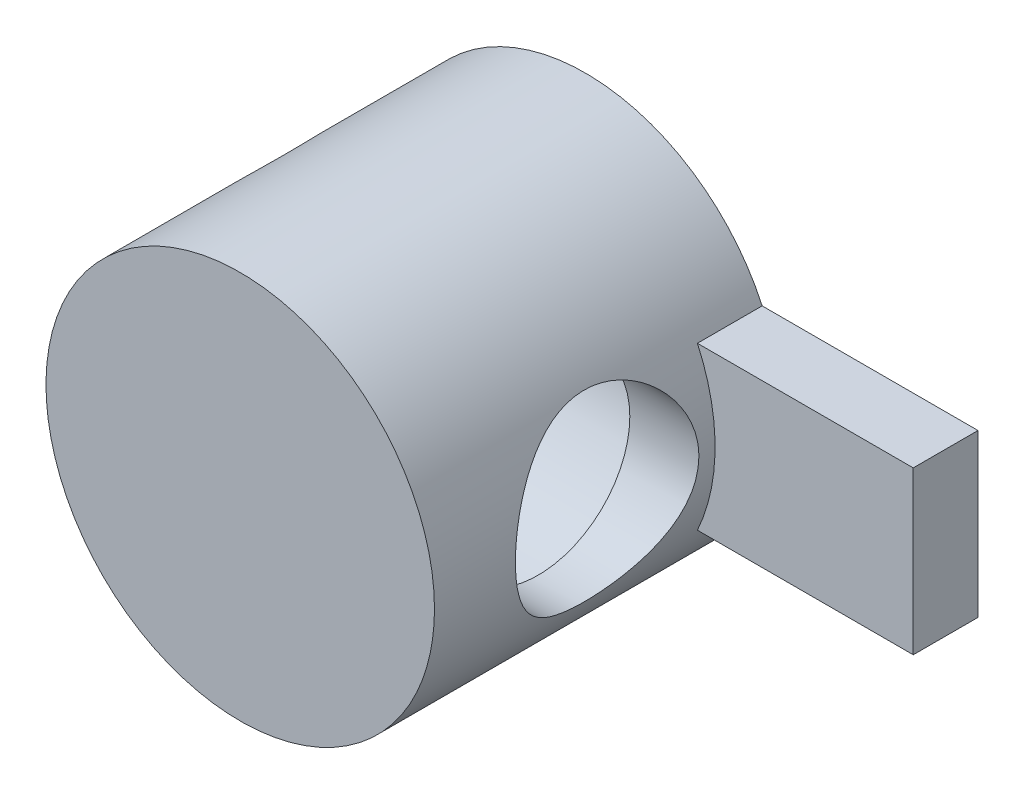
ISO-10303-21;
HEADER;
FILE_DESCRIPTION(('STEP AP214'),'2;1');
FILE_NAME('part.step','',(''),(''),'','','');
FILE_SCHEMA(('AUTOMOTIVE_DESIGN { 1 0 10303 214 1 1 1 1 }'));
ENDSEC;
DATA;
#1=APPLICATION_CONTEXT('core data for automotive mechanical design processes');
#2=APPLICATION_PROTOCOL_DEFINITION('international standard','automotive_design',2000,#1);
#3=PRODUCT_CONTEXT('',#1,'mechanical');
#4=PRODUCT('Part','Part','',(#3));
#5=PRODUCT_RELATED_PRODUCT_CATEGORY('part','',(#4));
#6=PRODUCT_DEFINITION_FORMATION('','',#4);
#7=PRODUCT_DEFINITION_CONTEXT('part definition',#1,'design');
#8=PRODUCT_DEFINITION('design','',#6,#7);
#9=PRODUCT_DEFINITION_SHAPE('','',#8);
#10=(LENGTH_UNIT() NAMED_UNIT(*) SI_UNIT(.MILLI.,.METRE.));
#11=(NAMED_UNIT(*) PLANE_ANGLE_UNIT() SI_UNIT($,.RADIAN.));
#12=(NAMED_UNIT(*) SI_UNIT($,.STERADIAN.) SOLID_ANGLE_UNIT());
#13=UNCERTAINTY_MEASURE_WITH_UNIT(LENGTH_MEASURE(1.E-05),#10,'distance_accuracy_value','');
#14=(GEOMETRIC_REPRESENTATION_CONTEXT(3) GLOBAL_UNCERTAINTY_ASSIGNED_CONTEXT((#13)) GLOBAL_UNIT_ASSIGNED_CONTEXT((#10,
#11,#12)) REPRESENTATION_CONTEXT('',''));
#15=CARTESIAN_POINT('',(0.,0.,0.));
#16=DIRECTION('',(0.,0.,1.));
#17=DIRECTION('',(1.,0.,0.));
#18=AXIS2_PLACEMENT_3D('',#15,#16,#17);
#19=CARTESIAN_POINT('',(0.,0.,8.));
#20=DIRECTION('',(0.,0.,-1.));
#21=DIRECTION('',(-1.,0.,0.));
#22=AXIS2_PLACEMENT_3D('',#19,#20,#21);
#23=CYLINDRICAL_SURFACE('',#22,9.);
#24=CARTESIAN_POINT('',(-9.,0.,6.75));
#25=CARTESIAN_POINT('',(-8.99999842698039,-0.164833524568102,6.74999837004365));
#26=CARTESIAN_POINT('',(-8.99546059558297,-0.329708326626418,6.74395113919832));
#27=CARTESIAN_POINT('',(-8.97741128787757,-0.658156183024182,6.71985678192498));
#28=CARTESIAN_POINT('',(-8.96389444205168,-0.821728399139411,6.70180247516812));
#29=CARTESIAN_POINT('',(-8.92817260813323,-1.14650348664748,6.65394772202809));
#30=CARTESIAN_POINT('',(-8.9059510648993,-1.30770123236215,6.62412489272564));
#31=CARTESIAN_POINT('',(-8.85331955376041,-1.62629043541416,6.5531924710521));
#32=CARTESIAN_POINT('',(-8.82290593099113,-1.78368015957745,6.51207784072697));
#33=CARTESIAN_POINT('',(-8.75477140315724,-2.09256295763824,6.41946268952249));
#34=CARTESIAN_POINT('',(-8.71709991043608,-2.24408802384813,6.36803230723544));
#35=CARTESIAN_POINT('',(-8.63506340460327,-2.54156013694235,6.25526249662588));
#36=CARTESIAN_POINT('',(-8.59069574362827,-2.68750494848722,6.193919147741));
#37=CARTESIAN_POINT('',(-8.44881158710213,-3.11573160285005,5.99611691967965));
#38=CARTESIAN_POINT('',(-8.34242195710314,-3.38880795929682,5.8457629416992));
#39=CARTESIAN_POINT('',(-8.10222374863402,-3.93064227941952,5.4978036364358));
#40=CARTESIAN_POINT('',(-7.96678840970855,-4.19665857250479,5.29711200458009));
#41=CARTESIAN_POINT('',(-7.68449624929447,-4.69363323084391,4.8622537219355));
#42=CARTESIAN_POINT('',(-7.53762195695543,-4.92453631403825,4.62803538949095));
#43=CARTESIAN_POINT('',(-7.30107493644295,-5.26484912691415,4.22879467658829));
#44=CARTESIAN_POINT('',(-7.211900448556,-5.38603829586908,4.07333143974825));
#45=CARTESIAN_POINT('',(-7.03523013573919,-5.61483758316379,3.75167526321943));
#46=CARTESIAN_POINT('',(-6.94773482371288,-5.72244360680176,3.58547911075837));
#47=CARTESIAN_POINT('',(-6.77721999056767,-5.92339751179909,3.24272597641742));
#48=CARTESIAN_POINT('',(-6.69419605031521,-6.01675964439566,3.06617959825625));
#49=CARTESIAN_POINT('',(-6.53575493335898,-6.18850139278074,2.702841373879));
#50=CARTESIAN_POINT('',(-6.46033343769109,-6.26688953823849,2.51605543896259));
#51=CARTESIAN_POINT('',(-6.29897361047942,-6.42960790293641,2.07229180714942));
#52=CARTESIAN_POINT('',(-6.21708569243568,-6.50817338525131,1.81158388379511));
#53=CARTESIAN_POINT('',(-6.11624435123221,-6.60255072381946,1.40987724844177));
#54=CARTESIAN_POINT('',(-6.08630638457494,-6.63008907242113,1.27428058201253));
#55=CARTESIAN_POINT('',(-6.03486987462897,-6.67694238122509,1.00012349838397));
#56=CARTESIAN_POINT('',(-6.01336698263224,-6.69626157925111,0.86156464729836));
#57=CARTESIAN_POINT('',(-5.97959538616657,-6.72643761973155,0.58105379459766));
#58=CARTESIAN_POINT('',(-5.96741601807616,-6.73721262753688,0.439082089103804));
#59=CARTESIAN_POINT('',(-5.95323912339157,-6.74974333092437,0.154229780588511));
#60=CARTESIAN_POINT('',(-5.9512413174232,-6.7514992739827,0.0113492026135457));
#61=CARTESIAN_POINT('',(-5.95753758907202,-6.74594437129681,-0.274056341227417));
#62=CARTESIAN_POINT('',(-5.96583503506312,-6.73863055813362,-0.416581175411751));
#63=CARTESIAN_POINT('',(-5.99228400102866,-6.71511944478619,-0.699936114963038));
#64=CARTESIAN_POINT('',(-6.01043562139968,-6.698922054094,-0.840766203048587));
#65=CARTESIAN_POINT('',(-6.07356895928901,-6.64189768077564,-1.22917471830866));
#66=CARTESIAN_POINT('',(-6.12842794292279,-6.59171717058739,-1.4738450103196));
#67=CARTESIAN_POINT('',(-6.26013279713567,-6.46674991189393,-1.95054367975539));
#68=CARTESIAN_POINT('',(-6.33699979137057,-6.39193951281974,-2.18255965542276));
#69=CARTESIAN_POINT('',(-6.48989238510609,-6.2362564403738,-2.59035253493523));
#70=CARTESIAN_POINT('',(-6.56339716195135,-6.15912150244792,-2.76854348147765));
#71=CARTESIAN_POINT('',(-6.71707949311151,-5.99114350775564,-3.11542288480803));
#72=CARTESIAN_POINT('',(-6.79726046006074,-5.90029342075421,-3.28410640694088));
#73=CARTESIAN_POINT('',(-6.96166040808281,-5.70539900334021,-3.61211745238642));
#74=CARTESIAN_POINT('',(-7.04588742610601,-5.60132767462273,-3.77142482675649));
#75=CARTESIAN_POINT('',(-7.21585398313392,-5.38059984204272,-4.08015259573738));
#76=CARTESIAN_POINT('',(-7.30159328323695,-5.26394531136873,-4.22957453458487));
#77=CARTESIAN_POINT('',(-7.47469307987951,-5.01522662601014,-4.52191945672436));
#78=CARTESIAN_POINT('',(-7.56203984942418,-4.88284775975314,-4.66458308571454));
#79=CARTESIAN_POINT('',(-7.73415281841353,-4.60538125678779,-4.93872416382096));
#80=CARTESIAN_POINT('',(-7.81891875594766,-4.46029233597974,-5.07020048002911));
#81=CARTESIAN_POINT('',(-7.9838039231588,-4.1579415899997,-5.32095172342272));
#82=CARTESIAN_POINT('',(-8.06393077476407,-4.00070078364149,-5.44024692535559));
#83=CARTESIAN_POINT('',(-8.21781425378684,-3.67424409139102,-5.6658424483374));
#84=CARTESIAN_POINT('',(-8.29157250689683,-3.5050312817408,-5.77214608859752));
#85=CARTESIAN_POINT('',(-8.41690632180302,-3.19035181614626,-5.95062956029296));
#86=CARTESIAN_POINT('',(-8.46996423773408,-3.04692749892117,-6.02537758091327));
#87=CARTESIAN_POINT('',(-8.56990314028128,-2.75332419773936,-6.16507279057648));
#88=CARTESIAN_POINT('',(-8.61678539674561,-2.60314661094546,-6.2300219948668));
#89=CARTESIAN_POINT('',(-8.70346814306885,-2.29673270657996,-6.34937316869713));
#90=CARTESIAN_POINT('',(-8.7432712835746,-2.14049868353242,-6.40377908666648));
#91=CARTESIAN_POINT('',(-8.8149872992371,-1.82277717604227,-6.50135339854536));
#92=CARTESIAN_POINT('',(-8.8469000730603,-1.66128962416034,-6.54452164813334));
#93=CARTESIAN_POINT('',(-8.90228401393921,-1.33311603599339,-6.61919879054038));
#94=CARTESIAN_POINT('',(-8.92570120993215,-1.1664038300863,-6.65063317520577));
#95=CARTESIAN_POINT('',(-8.96323880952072,-0.830049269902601,-6.70092759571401));
#96=CARTESIAN_POINT('',(-8.97735919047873,-0.660406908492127,-6.71978760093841));
#97=CARTESIAN_POINT('',(-8.995936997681,-0.319707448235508,-6.7445867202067));
#98=CARTESIAN_POINT('',(-9.00039764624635,-0.148650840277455,-6.75053014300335));
#99=CARTESIAN_POINT('',(-8.99954676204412,0.193386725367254,-6.74939573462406));
#100=CARTESIAN_POINT('',(-8.99423599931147,0.36436768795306,-6.74231892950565));
#101=CARTESIAN_POINT('',(-8.97500975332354,0.687535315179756,-6.71664813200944));
#102=CARTESIAN_POINT('',(-8.96201656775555,0.839877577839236,-6.69928828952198));
#103=CARTESIAN_POINT('',(-8.92851420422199,1.14226991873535,-6.65440375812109));
#104=CARTESIAN_POINT('',(-8.90800252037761,1.29231921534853,-6.62687568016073));
#105=CARTESIAN_POINT('',(-8.85987684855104,1.58908022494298,-6.56204153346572));
#106=CARTESIAN_POINT('',(-8.8322645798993,1.73579273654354,-6.52473783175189));
#107=CARTESIAN_POINT('',(-8.77044244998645,2.02515198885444,-6.44080476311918));
#108=CARTESIAN_POINT('',(-8.73623003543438,2.16779713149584,-6.39417178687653));
#109=CARTESIAN_POINT('',(-8.66051153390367,2.45317764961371,-6.29033131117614));
#110=CARTESIAN_POINT('',(-8.61879289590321,2.59574308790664,-6.23281204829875));
#111=CARTESIAN_POINT('',(-8.52965162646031,2.87516638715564,-6.10895239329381));
#112=CARTESIAN_POINT('',(-8.48222695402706,3.01202218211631,-6.04260884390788));
#113=CARTESIAN_POINT('',(-8.33255119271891,3.41319746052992,-5.8312821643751));
#114=CARTESIAN_POINT('',(-8.22283875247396,3.66834273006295,-5.67392251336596));
#115=CARTESIAN_POINT('',(-7.97035583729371,4.19184143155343,-5.30196091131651));
#116=CARTESIAN_POINT('',(-7.8251244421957,4.45528485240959,-5.0821880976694));
#117=CARTESIAN_POINT('',(-7.52572765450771,4.94425448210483,-4.60794405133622));
#118=CARTESIAN_POINT('',(-7.37154292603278,5.16969418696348,-4.35339598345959));
#119=CARTESIAN_POINT('',(-7.12763831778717,5.49728052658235,-3.92214430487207));
#120=CARTESIAN_POINT('',(-7.03707221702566,5.6124106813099,-3.75560622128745));
#121=CARTESIAN_POINT('',(-6.85952128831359,5.82807396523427,-3.41135345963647));
#122=CARTESIAN_POINT('',(-6.77253778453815,5.92860173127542,-3.23363470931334));
#123=CARTESIAN_POINT('',(-6.60562845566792,6.11401709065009,-2.86762190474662));
#124=CARTESIAN_POINT('',(-6.52568627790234,6.19894144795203,-2.67935410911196));
#125=CARTESIAN_POINT('',(-6.37653905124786,6.35225696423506,-2.29230742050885));
#126=CARTESIAN_POINT('',(-6.30732511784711,6.42066183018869,-2.09353740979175));
#127=CARTESIAN_POINT('',(-6.1703616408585,6.55268509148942,-1.64068123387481));
#128=CARTESIAN_POINT('',(-6.10632293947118,6.61189735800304,-1.38408516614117));
#129=CARTESIAN_POINT('',(-6.03356673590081,6.67810713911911,-0.991481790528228));
#130=CARTESIAN_POINT('',(-6.01320403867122,6.69640436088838,-0.859418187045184));
#131=CARTESIAN_POINT('',(-5.9809864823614,6.72519739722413,-0.593374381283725));
#132=CARTESIAN_POINT('',(-5.9691316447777,6.735693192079,-0.459394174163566));
#133=CARTESIAN_POINT('',(-5.95443857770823,6.74868566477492,-0.189857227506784));
#134=CARTESIAN_POINT('',(-5.95164715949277,6.75114081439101,-0.0542959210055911));
#135=CARTESIAN_POINT('',(-5.95533994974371,6.74788352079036,0.216598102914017));
#136=CARTESIAN_POINT('',(-5.96182396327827,6.74217124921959,0.351930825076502));
#137=CARTESIAN_POINT('',(-5.98377631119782,6.72269540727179,0.621396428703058));
#138=CARTESIAN_POINT('',(-5.99925286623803,6.70892446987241,0.755528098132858));
#139=CARTESIAN_POINT('',(-6.03852546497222,6.67359744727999,1.0215783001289));
#140=CARTESIAN_POINT('',(-6.06232592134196,6.65203723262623,1.15349561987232));
#141=CARTESIAN_POINT('',(-6.12330291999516,6.59600094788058,1.44271672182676));
#142=CARTESIAN_POINT('',(-6.16226320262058,6.55973520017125,1.59929781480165));
#143=CARTESIAN_POINT('',(-6.24924675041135,6.47692160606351,1.90720747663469));
#144=CARTESIAN_POINT('',(-6.29727685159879,6.43036599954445,2.05853198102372));
#145=CARTESIAN_POINT('',(-6.40055956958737,6.32757075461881,2.35565536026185));
#146=CARTESIAN_POINT('',(-6.45582644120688,6.27131193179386,2.50144257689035));
#147=CARTESIAN_POINT('',(-6.57170727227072,6.14977358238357,2.78690637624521));
#148=CARTESIAN_POINT('',(-6.63231960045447,6.08449680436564,2.92658480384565));
#149=CARTESIAN_POINT('',(-6.77904774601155,5.92117975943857,3.24727703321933));
#150=CARTESIAN_POINT('',(-6.8667115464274,5.81963309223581,3.42580406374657));
#151=CARTESIAN_POINT('',(-7.04563917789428,5.60168457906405,3.77166095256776));
#152=CARTESIAN_POINT('',(-7.13690412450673,5.48527810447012,3.93898729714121));
#153=CARTESIAN_POINT('',(-7.32031810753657,5.23800149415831,4.26230983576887));
#154=CARTESIAN_POINT('',(-7.41246775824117,5.1071205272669,4.41829739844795));
#155=CARTESIAN_POINT('',(-7.59512353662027,4.83130004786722,4.71832103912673));
#156=CARTESIAN_POINT('',(-7.68562986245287,4.68636224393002,4.86235856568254));
#157=CARTESIAN_POINT('',(-7.86350164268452,4.3814110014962,5.1389159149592));
#158=CARTESIAN_POINT('',(-7.95083429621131,4.22128106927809,5.27132873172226));
#159=CARTESIAN_POINT('',(-8.11933388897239,3.88733746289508,5.52220199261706));
#160=CARTESIAN_POINT('',(-8.20050002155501,3.7135220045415,5.64066061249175));
#161=CARTESIAN_POINT('',(-8.35430628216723,3.3531878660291,5.86201784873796));
#162=CARTESIAN_POINT('',(-8.42696250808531,3.16669426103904,5.96494595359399));
#163=CARTESIAN_POINT('',(-8.56174024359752,2.78174913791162,6.15388324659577));
#164=CARTESIAN_POINT('',(-8.62386718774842,2.58330386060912,6.23990116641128));
#165=CARTESIAN_POINT('',(-8.71916873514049,2.23571165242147,6.37085378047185));
#166=CARTESIAN_POINT('',(-8.75549234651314,2.08916105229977,6.42044069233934));
#167=CARTESIAN_POINT('',(-8.82119294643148,1.79157781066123,6.50975133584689));
#168=CARTESIAN_POINT('',(-8.85057162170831,1.64054626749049,6.54947746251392));
#169=CARTESIAN_POINT('',(-8.90174536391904,1.33522955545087,6.61846688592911));
#170=CARTESIAN_POINT('',(-8.92355795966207,1.18095279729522,6.64775437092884));
#171=CARTESIAN_POINT('',(-8.95922870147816,0.869886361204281,6.69556076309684));
#172=CARTESIAN_POINT('',(-8.97309091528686,0.713098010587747,6.71408517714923));
#173=CARTESIAN_POINT('',(-8.98854076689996,0.463352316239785,6.73471512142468));
#174=CARTESIAN_POINT('',(-8.99283413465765,0.370840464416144,6.7404430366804));
#175=CARTESIAN_POINT('',(-8.99856442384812,0.185556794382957,6.74808624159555));
#176=CARTESIAN_POINT('',(-9.00000088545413,0.0927849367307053,6.75000091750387));
#177=CARTESIAN_POINT('',(-9.,0.,6.75));
#178=B_SPLINE_CURVE_WITH_KNOTS('',3,(#24,#25,#26,#27,#28,#29,#30,#31,#32,#33,#34,#35,#36,#37,
#38,#39,#40,#41,#42,#43,#44,#45,#46,#47,#48,#49,#50,#51,#52,#53,#54,#55,#56,#57,#58,#59,#60,#61,
#62,#63,#64,#65,#66,#67,#68,#69,#70,#71,#72,#73,#74,#75,#76,#77,#78,#79,#80,#81,#82,#83,#84,#85,
#86,#87,#88,#89,#90,#91,#92,#93,#94,#95,#96,#97,#98,#99,#100,#101,#102,#103,#104,#105,#106,#107,
#108,#109,#110,#111,#112,#113,#114,#115,#116,#117,#118,#119,#120,#121,#122,#123,#124,#125,#126,
#127,#128,#129,#130,#131,#132,#133,#134,#135,#136,#137,#138,#139,#140,#141,#142,#143,#144,#145,
#146,#147,#148,#149,#150,#151,#152,#153,#154,#155,#156,#157,#158,#159,#160,#161,#162,#163,#164,
#165,#166,#167,#168,#169,#170,#171,#172,#173,#174,#175,#176,#177),.UNSPECIFIED.,.T.,.F.,(4,2,2,
2,2,2,2,2,2,2,2,2,2,2,2,2,2,2,2,2,2,2,2,2,2,2,2,2,2,2,2,2,2,2,2,2,2,2,2,2,2,2,2,2,2,2,2,2,2,2,2,
2,2,2,2,2,2,2,2,2,2,2,2,2,2,2,2,2,2,2,2,2,2,2,2,2,4),(0.,0.494400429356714,0.989096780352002,
1.48473857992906,1.98060187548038,2.47320151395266,2.96599645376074,3.95030874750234,
5.02577236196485,6.10291203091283,6.75136837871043,7.40001974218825,8.04801780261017,
8.69564563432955,9.5451531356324,9.969427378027,10.3934825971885,10.821551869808,
11.2496093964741,11.6778070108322,12.1060089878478,12.8700593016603,13.6348454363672,
14.2568853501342,14.8792452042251,15.5028970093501,16.1264511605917,16.7657496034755,
17.4051127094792,18.043393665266,18.6815112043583,19.1916710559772,19.7017258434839,
20.2115892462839,20.7214591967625,21.2345137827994,21.7475696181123,22.2604542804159,
22.7732985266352,23.2343960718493,23.6956474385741,24.1567872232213,24.61810576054,
25.0954935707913,25.5730526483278,26.5274583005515,27.6412500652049,28.7575437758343,
29.4222584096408,30.0872165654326,30.7505873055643,31.4134057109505,32.2228461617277,
32.6270369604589,33.0312287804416,33.4375049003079,33.8437724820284,34.250412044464,
34.6572675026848,35.1526614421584,35.6484302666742,36.1451907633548,36.6418001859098,
37.3108366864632,37.9800820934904,38.6498317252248,39.3195000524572,39.9947981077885,
40.670184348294,41.3442716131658,42.0180098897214,42.4942984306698,42.970471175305,
43.4455332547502,43.9203520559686,44.1986057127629,44.4769041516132),.UNSPECIFIED.);
#179=CARTESIAN_POINT('',(-9.,0.,6.75));
#180=VERTEX_POINT('',#179);
#181=EDGE_CURVE('E115',#180,#180,#178,.T.);
#182=ORIENTED_EDGE('',*,*,#181,.T.);
#183=EDGE_LOOP('',(#182));
#184=FACE_BOUND('',#183,.T.);
#185=CARTESIAN_POINT('',(9.,0.,-4.25));
#186=CARTESIAN_POINT('',(8.99999933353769,-0.112498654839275,-4.24999921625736));
#187=CARTESIAN_POINT('',(8.99788524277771,-0.225016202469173,-4.24552740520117));
#188=CARTESIAN_POINT('',(8.98948230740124,-0.449230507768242,-4.22768871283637));
#189=CARTESIAN_POINT('',(8.98319135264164,-0.560926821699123,-4.2143173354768));
#190=CARTESIAN_POINT('',(8.96658227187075,-0.78280933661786,-4.17879729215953));
#191=CARTESIAN_POINT('',(8.95625745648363,-0.892992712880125,-4.15663404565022));
#192=CARTESIAN_POINT('',(8.93185239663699,-1.1108850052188,-4.1037820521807));
#193=CARTESIAN_POINT('',(8.91777061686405,-1.218592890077,-4.07308981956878));
#194=CARTESIAN_POINT('',(8.87052051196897,-1.53600809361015,-3.96894450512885));
#195=CARTESIAN_POINT('',(8.83226113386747,-1.74109146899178,-3.88324593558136));
#196=CARTESIAN_POINT('',(8.74575827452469,-2.13359995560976,-3.682252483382));
#197=CARTESIAN_POINT('',(8.69751631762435,-2.32102775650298,-3.56696211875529));
#198=CARTESIAN_POINT('',(8.5924159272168,-2.68480331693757,-3.30266660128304));
#199=CARTESIAN_POINT('',(8.53522727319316,-2.85995288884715,-3.15214152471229));
#200=CARTESIAN_POINT('',(8.41988039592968,-3.18358283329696,-2.82495443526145));
#201=CARTESIAN_POINT('',(8.36172154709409,-3.33204520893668,-2.64827493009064));
#202=CARTESIAN_POINT('',(8.24653432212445,-3.60812304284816,-2.2592994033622));
#203=CARTESIAN_POINT('',(8.18984438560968,-3.73366790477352,-2.04540802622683));
#204=CARTESIAN_POINT('',(8.11457657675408,-3.89321290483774,-1.70905096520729));
#205=CARTESIAN_POINT('',(8.09110860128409,-3.94161118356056,-1.59430204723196));
#206=CARTESIAN_POINT('',(8.04828174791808,-4.02833732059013,-1.36034190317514));
#207=CARTESIAN_POINT('',(8.02892055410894,-4.06667085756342,-1.24113323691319));
#208=CARTESIAN_POINT('',(7.99603800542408,-4.13093289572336,-1.00594071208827));
#209=CARTESIAN_POINT('',(7.98225006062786,-4.15743647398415,-0.890150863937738));
#210=CARTESIAN_POINT('',(7.95957035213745,-4.20069501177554,-0.656341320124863));
#211=CARTESIAN_POINT('',(7.95067611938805,-4.21745488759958,-0.538322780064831));
#212=CARTESIAN_POINT('',(7.93814323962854,-4.24099765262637,-0.301070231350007));
#213=CARTESIAN_POINT('',(7.9345021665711,-4.24778514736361,-0.181836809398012));
#214=CARTESIAN_POINT('',(7.93262203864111,-4.25129535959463,0.0568146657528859));
#215=CARTESIAN_POINT('',(7.93438256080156,-4.24801886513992,0.176232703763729));
#216=CARTESIAN_POINT('',(7.94276894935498,-4.23231493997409,0.401775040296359));
#217=CARTESIAN_POINT('',(7.94886916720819,-4.22087579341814,0.507988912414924));
#218=CARTESIAN_POINT('',(7.96513124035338,-4.19010459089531,0.718962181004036));
#219=CARTESIAN_POINT('',(7.97529439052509,-4.17077001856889,0.823721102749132));
#220=CARTESIAN_POINT('',(8.01142084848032,-4.1012126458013,1.13471629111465));
#221=CARTESIAN_POINT('',(8.04302817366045,-4.0394241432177,1.33783864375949));
#222=CARTESIAN_POINT('',(8.11846261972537,-3.88561311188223,1.73524012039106));
#223=CARTESIAN_POINT('',(8.1625558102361,-3.79292347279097,1.92920546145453));
#224=CARTESIAN_POINT('',(8.25798000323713,-3.58040708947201,2.2997419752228));
#225=CARTESIAN_POINT('',(8.30931418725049,-3.46056840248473,2.47630544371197));
#226=CARTESIAN_POINT('',(8.42036211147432,-3.18158332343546,2.82769194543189));
#227=CARTESIAN_POINT('',(8.4803720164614,-3.01954416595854,3.00012642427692));
#228=CARTESIAN_POINT('',(8.5973350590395,-2.6683307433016,3.31636619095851));
#229=CARTESIAN_POINT('',(8.65428701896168,-2.47914612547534,3.46016050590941));
#230=CARTESIAN_POINT('',(8.73403179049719,-2.1744742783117,3.65368502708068));
#231=CARTESIAN_POINT('',(8.76008411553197,-2.06728005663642,3.71540331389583));
#232=CARTESIAN_POINT('',(8.80908015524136,-1.84736767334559,3.82949782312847));
#233=CARTESIAN_POINT('',(8.83202516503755,-1.7346518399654,3.88187794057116));
#234=CARTESIAN_POINT('',(8.8741297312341,-1.50449601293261,3.97674287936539));
#235=CARTESIAN_POINT('',(8.89329059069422,-1.38705766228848,4.01923110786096));
#236=CARTESIAN_POINT('',(8.92725566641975,-1.14831826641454,4.09383667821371));
#237=CARTESIAN_POINT('',(8.94206032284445,-1.02701761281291,4.12595506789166));
#238=CARTESIAN_POINT('',(8.96589846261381,-0.790975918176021,4.17735700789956));
#239=CARTESIAN_POINT('',(8.9752868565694,-0.676443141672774,4.19743458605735));
#240=CARTESIAN_POINT('',(8.98969184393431,-0.445849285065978,4.22814905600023));
#241=CARTESIAN_POINT('',(8.99470876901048,-0.329788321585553,4.23878666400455));
#242=CARTESIAN_POINT('',(9.0002281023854,-0.0971156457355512,4.25048615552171));
#243=CARTESIAN_POINT('',(9.000731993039,0.0194958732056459,4.25155118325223));
#244=CARTESIAN_POINT('',(8.99721526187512,0.25233975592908,4.24410096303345));
#245=CARTESIAN_POINT('',(8.99319480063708,0.368572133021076,4.23558605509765));
#246=CARTESIAN_POINT('',(8.981164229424,0.591885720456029,4.20997983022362));
#247=CARTESIAN_POINT('',(8.97344256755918,0.69905385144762,4.19350799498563));
#248=CARTESIAN_POINT('',(8.95435863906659,0.911518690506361,4.15251237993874));
#249=CARTESIAN_POINT('',(8.94299520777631,1.01681478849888,4.12798602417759));
#250=CARTESIAN_POINT('',(8.9038239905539,1.32878689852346,4.0426724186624));
#251=CARTESIAN_POINT('',(8.87092390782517,1.53174474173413,3.97012747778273));
#252=CARTESIAN_POINT('',(8.79334418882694,1.9285553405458,3.79365841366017));
#253=CARTESIAN_POINT('',(8.74833677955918,2.12194356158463,3.68884718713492));
#254=CARTESIAN_POINT('',(8.65103876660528,2.48910085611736,3.45175988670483));
#255=CARTESIAN_POINT('',(8.59874497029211,2.66286126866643,3.31947176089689));
#256=CARTESIAN_POINT('',(8.48653917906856,3.00223389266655,3.01748991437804));
#257=CARTESIAN_POINT('',(8.42636439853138,3.16572145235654,2.84550682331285));
#258=CARTESIAN_POINT('',(8.30886369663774,3.46241106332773,2.47594591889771));
#259=CARTESIAN_POINT('',(8.25153924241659,3.59559764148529,2.27835510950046));
#260=CARTESIAN_POINT('',(8.17176407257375,3.77182152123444,1.96243080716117));
#261=CARTESIAN_POINT('',(8.14582033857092,3.82737156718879,1.85179097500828));
#262=CARTESIAN_POINT('',(8.09737324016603,3.92882997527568,1.62546910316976));
#263=CARTESIAN_POINT('',(8.07486833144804,3.9747426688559,1.50978935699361));
#264=CARTESIAN_POINT('',(8.03416258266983,4.05639193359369,1.27425033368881));
#265=CARTESIAN_POINT('',(8.01595871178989,4.09213567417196,1.15439406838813));
#266=CARTESIAN_POINT('',(7.98458490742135,4.15302071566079,0.911373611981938));
#267=CARTESIAN_POINT('',(7.97141430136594,4.1781634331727,0.788209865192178));
#268=CARTESIAN_POINT('',(7.95163350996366,4.21567674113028,0.55103568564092));
#269=CARTESIAN_POINT('',(7.94453398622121,4.22900415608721,0.437216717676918));
#270=CARTESIAN_POINT('',(7.93523874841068,4.24642019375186,0.208679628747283));
#271=CARTESIAN_POINT('',(7.93304263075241,4.25050957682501,0.0939615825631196));
#272=CARTESIAN_POINT('',(7.93364311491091,4.24938944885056,-0.135392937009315));
#273=CARTESIAN_POINT('',(7.93643846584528,4.24418226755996,-0.250029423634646));
#274=CARTESIAN_POINT('',(7.94689863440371,4.22456041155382,-0.478254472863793));
#275=CARTESIAN_POINT('',(7.95456332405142,4.21014597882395,-0.591843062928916));
#276=CARTESIAN_POINT('',(7.98294059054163,4.15623817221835,-0.912435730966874));
#277=CARTESIAN_POINT('',(8.00920588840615,4.10584507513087,-1.11723162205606));
#278=CARTESIAN_POINT('',(8.07431953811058,3.97624684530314,-1.51521785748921));
#279=CARTESIAN_POINT('',(8.1131716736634,3.89703304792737,-1.70840469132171));
#280=CARTESIAN_POINT('',(8.20225075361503,3.70606066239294,-2.09201032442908));
#281=CARTESIAN_POINT('',(8.25306296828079,3.59248581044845,-2.28138770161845));
#282=CARTESIAN_POINT('',(8.35915547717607,3.33818502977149,-2.6395676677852));
#283=CARTESIAN_POINT('',(8.41443789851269,3.19744613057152,-2.80836036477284));
#284=CARTESIAN_POINT('',(8.53010701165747,2.8756651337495,-3.13872616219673));
#285=CARTESIAN_POINT('',(8.5904283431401,2.69195673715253,-3.29773423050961));
#286=CARTESIAN_POINT('',(8.70397440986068,2.29839729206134,-3.5831353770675));
#287=CARTESIAN_POINT('',(8.75719570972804,2.08853368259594,-3.70951269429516));
#288=CARTESIAN_POINT('',(8.82722518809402,1.75863121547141,-3.87100887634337));
#289=CARTESIAN_POINT('',(8.84891522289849,1.64628406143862,-3.9201221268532));
#290=CARTESIAN_POINT('',(8.88847732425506,1.4171952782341,-4.00862899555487));
#291=CARTESIAN_POINT('',(8.90635125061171,1.30045582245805,-4.04802734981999));
#292=CARTESIAN_POINT('',(8.93771246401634,1.0637332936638,-4.11656754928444));
#293=CARTESIAN_POINT('',(8.9512098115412,0.943758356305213,-4.14573292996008));
#294=CARTESIAN_POINT('',(8.97345474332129,0.701355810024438,-4.19354757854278));
#295=CARTESIAN_POINT('',(8.98220543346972,0.578929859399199,-4.21220372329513));
#296=CARTESIAN_POINT('',(8.99228495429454,0.380205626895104,-4.23364327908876));
#297=CARTESIAN_POINT('',(8.99517461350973,0.304329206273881,-4.23977345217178));
#298=CARTESIAN_POINT('',(8.99903238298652,0.152304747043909,-4.24795212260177));
#299=CARTESIAN_POINT('',(9.00000045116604,0.0761567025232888,-4.25000053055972));
#300=CARTESIAN_POINT('',(9.,0.,-4.25));
#301=B_SPLINE_CURVE_WITH_KNOTS('',3,(#185,#186,#187,#188,#189,#190,#191,#192,#193,#194,#195,
#196,#197,#198,#199,#200,#201,#202,#203,#204,#205,#206,#207,#208,#209,#210,#211,#212,#213,#214,
#215,#216,#217,#218,#219,#220,#221,#222,#223,#224,#225,#226,#227,#228,#229,#230,#231,#232,#233,
#234,#235,#236,#237,#238,#239,#240,#241,#242,#243,#244,#245,#246,#247,#248,#249,#250,#251,#252,
#253,#254,#255,#256,#257,#258,#259,#260,#261,#262,#263,#264,#265,#266,#267,#268,#269,#270,#271,
#272,#273,#274,#275,#276,#277,#278,#279,#280,#281,#282,#283,#284,#285,#286,#287,#288,#289,#290,
#291,#292,#293,#294,#295,#296,#297,#298,#299,#300),.UNSPECIFIED.,.T.,.F.,(4,2,2,2,2,2,2,2,2,2,2,
2,2,2,2,2,2,2,2,2,2,2,2,2,2,2,2,2,2,2,2,2,2,2,2,2,2,2,2,2,2,2,2,2,2,2,2,2,2,2,2,2,2,2,2,2,2,4),
(0.,0.337419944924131,0.675010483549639,1.01316324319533,1.35145440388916,2.02477200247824,
2.69798686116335,3.40869002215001,4.11987067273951,4.87882960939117,5.2585771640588,
5.63810999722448,5.9963604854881,6.35443005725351,6.71233421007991,7.07021033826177,
7.39082555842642,7.71154304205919,8.35247955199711,9.00826091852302,9.66433132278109,
10.393544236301,11.1230359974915,11.5018342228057,11.8804740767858,12.2589833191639,
12.6374543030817,12.9869661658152,13.3364515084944,13.685822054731,14.0351802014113,
14.360892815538,14.6867096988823,15.3377516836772,16.0085906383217,16.6797244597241,
17.4109849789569,18.1426180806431,18.5216658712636,18.900542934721,19.2791522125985,
19.6577108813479,20.0016927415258,20.3456462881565,20.689513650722,21.0333719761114,
21.6679272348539,22.3026734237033,22.9796976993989,23.6570460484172,24.404654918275,
25.1526242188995,25.5257496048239,25.8986927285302,26.2707723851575,26.6426082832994,
26.8710219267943,27.0994405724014),.UNSPECIFIED.);
#302=CARTESIAN_POINT('',(9.,0.,-4.25));
#303=VERTEX_POINT('',#302);
#304=EDGE_CURVE('E103',#303,#303,#301,.T.);
#305=ORIENTED_EDGE('',*,*,#304,.T.);
#306=EDGE_LOOP('',(#305));
#307=FACE_BOUND('',#306,.T.);
#308=CARTESIAN_POINT('',(0.,0.,-8.));
#309=DIRECTION('',(0.,0.,1.));
#310=DIRECTION('',(1.,0.,0.));
#311=AXIS2_PLACEMENT_3D('',#308,#309,#310);
#312=CIRCLE('',#311,9.);
#313=CARTESIAN_POINT('',(8.18153408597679,3.75,-8.));
#314=VERTEX_POINT('',#313);
#315=CARTESIAN_POINT('',(8.18153408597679,-3.75,-8.));
#316=VERTEX_POINT('',#315);
#317=EDGE_CURVE('E40',#314,#316,#312,.T.);
#318=ORIENTED_EDGE('',*,*,#317,.T.);
#319=DIRECTION('',(0.,0.,-1.));
#320=VECTOR('',#319,1.);
#321=CARTESIAN_POINT('',(8.18153408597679,-3.75,-5.));
#322=LINE('',#321,#320);
#323=CARTESIAN_POINT('',(8.18153408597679,-3.75,-5.));
#324=VERTEX_POINT('',#323);
#325=EDGE_CURVE('E48',#324,#316,#322,.T.);
#326=ORIENTED_EDGE('',*,*,#325,.F.);
#327=CARTESIAN_POINT('',(-1.406513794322E-11,0.,-5.));
#328=DIRECTION('',(0.,0.,1.));
#329=DIRECTION('',(-1.,0.,0.));
#330=AXIS2_PLACEMENT_3D('',#327,#328,#329);
#331=CIRCLE('',#330,9.00000000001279);
#332=CARTESIAN_POINT('',(8.18153408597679,3.75,-5.));
#333=VERTEX_POINT('',#332);
#334=EDGE_CURVE('E52',#324,#333,#331,.T.);
#335=ORIENTED_EDGE('',*,*,#334,.T.);
#336=DIRECTION('',(0.,0.,-1.));
#337=VECTOR('',#336,1.);
#338=CARTESIAN_POINT('',(8.18153408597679,3.75,-5.));
#339=LINE('',#338,#337);
#340=EDGE_CURVE('E85',#333,#314,#339,.T.);
#341=ORIENTED_EDGE('',*,*,#340,.T.);
#342=EDGE_LOOP('',(#318,#326,#335,#341));
#343=FACE_BOUND('',#342,.T.);
#344=CARTESIAN_POINT('',(0.,0.,8.));
#345=DIRECTION('',(0.,0.,1.));
#346=DIRECTION('',(1.,0.,0.));
#347=AXIS2_PLACEMENT_3D('',#344,#345,#346);
#348=CIRCLE('',#347,9.);
#349=CARTESIAN_POINT('',(9.,0.,8.));
#350=VERTEX_POINT('',#349);
#351=EDGE_CURVE('E11',#350,#350,#348,.T.);
#352=ORIENTED_EDGE('',*,*,#351,.F.);
#353=EDGE_LOOP('',(#352));
#354=FACE_BOUND('',#353,.T.);
#355=ADVANCED_FACE('F31',(#184,#307,#343,#354),#23,.T.);
#356=CARTESIAN_POINT('',(0.,0.,8.));
#357=DIRECTION('',(0.,0.,1.));
#358=DIRECTION('',(1.,0.,0.));
#359=AXIS2_PLACEMENT_3D('',#356,#357,#358);
#360=PLANE('',#359);
#361=ORIENTED_EDGE('',*,*,#351,.T.);
#362=EDGE_LOOP('',(#361));
#363=FACE_BOUND('',#362,.T.);
#364=ADVANCED_FACE('F138',(#363),#360,.T.);
#365=CARTESIAN_POINT('',(0.,0.,-8.));
#366=DIRECTION('',(0.,0.,1.));
#367=DIRECTION('',(1.,0.,0.));
#368=AXIS2_PLACEMENT_3D('',#365,#366,#367);
#369=PLANE('',#368);
#370=ORIENTED_EDGE('',*,*,#317,.F.);
#371=DIRECTION('',(1.,0.,0.));
#372=VECTOR('',#371,1.);
#373=CARTESIAN_POINT('',(8.18153408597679,3.75,-8.));
#374=LINE('',#373,#372);
#375=CARTESIAN_POINT('',(18.1815340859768,3.75,-8.));
#376=VERTEX_POINT('',#375);
#377=EDGE_CURVE('E101',#314,#376,#374,.T.);
#378=ORIENTED_EDGE('',*,*,#377,.T.);
#379=DIRECTION('',(0.,-1.,0.));
#380=VECTOR('',#379,1.);
#381=CARTESIAN_POINT('',(18.1815340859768,3.75,-8.));
#382=LINE('',#381,#380);
#383=CARTESIAN_POINT('',(18.1815340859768,-3.75,-8.));
#384=VERTEX_POINT('',#383);
#385=EDGE_CURVE('E79',#376,#384,#382,.T.);
#386=ORIENTED_EDGE('',*,*,#385,.T.);
#387=DIRECTION('',(-1.,0.,0.));
#388=VECTOR('',#387,1.);
#389=CARTESIAN_POINT('',(18.1815340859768,-3.75,-8.));
#390=LINE('',#389,#388);
#391=EDGE_CURVE('E96',#384,#316,#390,.T.);
#392=ORIENTED_EDGE('',*,*,#391,.T.);
#393=EDGE_LOOP('',(#370,#378,#386,#392));
#394=FACE_BOUND('',#393,.T.);
#395=ADVANCED_FACE('F132',(#394),#369,.F.);
#396=CARTESIAN_POINT('',(18.1815340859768,-3.75,-5.));
#397=DIRECTION('',(0.,-1.,0.));
#398=DIRECTION('',(0.,0.,-1.));
#399=AXIS2_PLACEMENT_3D('',#396,#397,#398);
#400=PLANE('',#399);
#401=ORIENTED_EDGE('',*,*,#391,.F.);
#402=DIRECTION('',(0.,0.,-1.));
#403=VECTOR('',#402,1.);
#404=CARTESIAN_POINT('',(18.1815340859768,-3.75,-5.));
#405=LINE('',#404,#403);
#406=CARTESIAN_POINT('',(18.1815340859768,-3.75,-5.));
#407=VERTEX_POINT('',#406);
#408=EDGE_CURVE('E84',#407,#384,#405,.T.);
#409=ORIENTED_EDGE('',*,*,#408,.F.);
#410=DIRECTION('',(-1.,0.,0.));
#411=VECTOR('',#410,1.);
#412=CARTESIAN_POINT('',(18.1815340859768,-3.75,-5.));
#413=LINE('',#412,#411);
#414=EDGE_CURVE('E92',#407,#324,#413,.T.);
#415=ORIENTED_EDGE('',*,*,#414,.T.);
#416=ORIENTED_EDGE('',*,*,#325,.T.);
#417=EDGE_LOOP('',(#401,#409,#415,#416));
#418=FACE_BOUND('',#417,.T.);
#419=ADVANCED_FACE('F129',(#418),#400,.T.);
#420=CARTESIAN_POINT('',(18.1815340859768,3.75,-5.));
#421=DIRECTION('',(1.,0.,0.));
#422=DIRECTION('',(0.,0.,-1.));
#423=AXIS2_PLACEMENT_3D('',#420,#421,#422);
#424=PLANE('',#423);
#425=ORIENTED_EDGE('',*,*,#385,.F.);
#426=DIRECTION('',(0.,0.,-1.));
#427=VECTOR('',#426,1.);
#428=CARTESIAN_POINT('',(18.1815340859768,3.75,-5.));
#429=LINE('',#428,#427);
#430=CARTESIAN_POINT('',(18.1815340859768,3.75,-5.));
#431=VERTEX_POINT('',#430);
#432=EDGE_CURVE('E73',#431,#376,#429,.T.);
#433=ORIENTED_EDGE('',*,*,#432,.F.);
#434=DIRECTION('',(0.,-1.,0.));
#435=VECTOR('',#434,1.);
#436=CARTESIAN_POINT('',(18.1815340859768,3.75,-5.));
#437=LINE('',#436,#435);
#438=EDGE_CURVE('E76',#431,#407,#437,.T.);
#439=ORIENTED_EDGE('',*,*,#438,.T.);
#440=ORIENTED_EDGE('',*,*,#408,.T.);
#441=EDGE_LOOP('',(#425,#433,#439,#440));
#442=FACE_BOUND('',#441,.T.);
#443=ADVANCED_FACE('F75',(#442),#424,.T.);
#444=CARTESIAN_POINT('',(8.18153408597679,3.75,-5.));
#445=DIRECTION('',(0.,1.,0.));
#446=DIRECTION('',(-1.,0.,0.));
#447=AXIS2_PLACEMENT_3D('',#444,#445,#446);
#448=PLANE('',#447);
#449=ORIENTED_EDGE('',*,*,#377,.F.);
#450=ORIENTED_EDGE('',*,*,#340,.F.);
#451=DIRECTION('',(1.,0.,0.));
#452=VECTOR('',#451,1.);
#453=CARTESIAN_POINT('',(8.18153408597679,3.75,-5.));
#454=LINE('',#453,#452);
#455=EDGE_CURVE('E90',#333,#431,#454,.T.);
#456=ORIENTED_EDGE('',*,*,#455,.T.);
#457=ORIENTED_EDGE('',*,*,#432,.T.);
#458=EDGE_LOOP('',(#449,#450,#456,#457));
#459=FACE_BOUND('',#458,.T.);
#460=ADVANCED_FACE('F94',(#459),#448,.T.);
#461=CARTESIAN_POINT('',(-1.406513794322E-11,0.,-5.));
#462=DIRECTION('',(0.,0.,-1.));
#463=DIRECTION('',(-1.,0.,0.));
#464=AXIS2_PLACEMENT_3D('',#461,#462,#463);
#465=PLANE('',#464);
#466=ORIENTED_EDGE('',*,*,#334,.F.);
#467=ORIENTED_EDGE('',*,*,#414,.F.);
#468=ORIENTED_EDGE('',*,*,#438,.F.);
#469=ORIENTED_EDGE('',*,*,#455,.F.);
#470=EDGE_LOOP('',(#466,#467,#468,#469));
#471=FACE_BOUND('',#470,.T.);
#472=ADVANCED_FACE('F89',(#471),#465,.F.);
#473=CARTESIAN_POINT('',(-10.,0.,0.));
#474=DIRECTION('',(1.,0.,0.));
#475=DIRECTION('',(0.,0.,-1.));
#476=AXIS2_PLACEMENT_3D('',#473,#474,#475);
#477=CYLINDRICAL_SURFACE('',#476,4.25);
#478=CARTESIAN_POINT('',(5.8,0.,0.));
#479=DIRECTION('',(1.,0.,0.));
#480=DIRECTION('',(0.,0.,-1.));
#481=AXIS2_PLACEMENT_3D('',#478,#479,#480);
#482=CIRCLE('',#481,4.25);
#483=CARTESIAN_POINT('',(5.8,0.,-4.25));
#484=VERTEX_POINT('',#483);
#485=EDGE_CURVE('E35',#484,#484,#482,.F.);
#486=ORIENTED_EDGE('',*,*,#485,.T.);
#487=EDGE_LOOP('',(#486));
#488=FACE_BOUND('',#487,.T.);
#489=ORIENTED_EDGE('',*,*,#304,.F.);
#490=EDGE_LOOP('',(#489));
#491=FACE_BOUND('',#490,.T.);
#492=ADVANCED_FACE('F119',(#488,#491),#477,.F.);
#493=CARTESIAN_POINT('',(-20.,0.,0.));
#494=DIRECTION('',(1.,0.,0.));
#495=DIRECTION('',(0.,0.,-1.));
#496=AXIS2_PLACEMENT_3D('',#493,#494,#495);
#497=CYLINDRICAL_SURFACE('',#496,6.75);
#498=ORIENTED_EDGE('',*,*,#181,.F.);
#499=EDGE_LOOP('',(#498));
#500=FACE_BOUND('',#499,.T.);
#501=CARTESIAN_POINT('',(5.8,0.,0.));
#502=DIRECTION('',(1.,0.,0.));
#503=DIRECTION('',(0.,0.,-1.));
#504=AXIS2_PLACEMENT_3D('',#501,#502,#503);
#505=CIRCLE('',#504,6.75);
#506=CARTESIAN_POINT('',(5.8,0.,-6.75));
#507=VERTEX_POINT('',#506);
#508=EDGE_CURVE('E159',#507,#507,#505,.T.);
#509=ORIENTED_EDGE('',*,*,#508,.T.);
#510=EDGE_LOOP('',(#509));
#511=FACE_BOUND('',#510,.T.);
#512=ADVANCED_FACE('F123',(#500,#511),#497,.F.);
#513=CARTESIAN_POINT('',(5.8,0.,0.));
#514=DIRECTION('',(1.,0.,0.));
#515=DIRECTION('',(0.,0.,-1.));
#516=AXIS2_PLACEMENT_3D('',#513,#514,#515);
#517=PLANE('',#516);
#518=ORIENTED_EDGE('',*,*,#508,.F.);
#519=EDGE_LOOP('',(#518));
#520=FACE_BOUND('',#519,.T.);
#521=ORIENTED_EDGE('',*,*,#485,.F.);
#522=EDGE_LOOP('',(#521));
#523=FACE_BOUND('',#522,.T.);
#524=ADVANCED_FACE('F165',(#520,#523),#517,.F.);
#525=CLOSED_SHELL('',(#355,#364,#395,#419,#443,#460,#472,#492,#512,#524));
#526=MANIFOLD_SOLID_BREP('B2',#525);
#527=ADVANCED_BREP_SHAPE_REPRESENTATION('',(#18,#526),#14);
#528=SHAPE_DEFINITION_REPRESENTATION(#9,#527);
ENDSEC;
END-ISO-10303-21;
